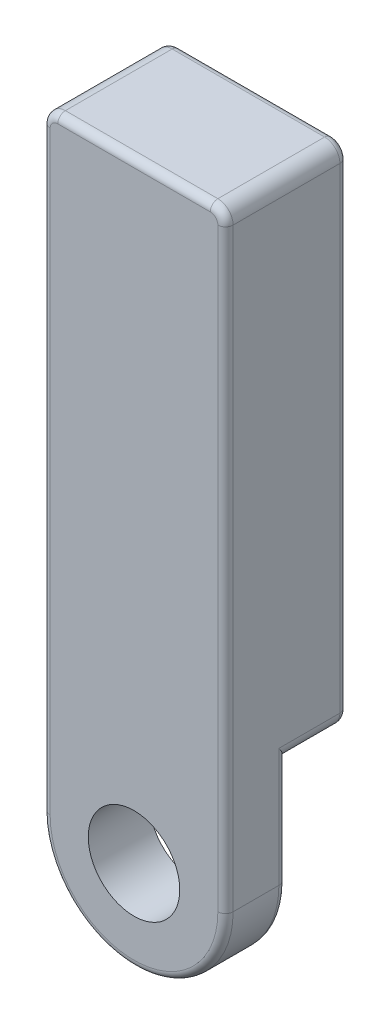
from build123d import *

# Parameters (mm, degrees)
SKETCH1_R          = 9.525
BASE_EXTRUDE_DEPTH = 25.4
SKETCH2_R          = 26.19375
CUT_EXTRUDE1_DEPTH = 12.7
FILLET1_R          = 3.175
FILLET2_R          = 1.5875


with BuildPart() as part:
    # Sketch1 → Base-Extrude (new body)
    with BuildSketch(Plane.XY):
        with BuildLine():
            Line((-19.05, 0), (-19.05, 127))
            Line((-19.05, 127), (19.05, 127))
            Line((19.05, 127), (19.05, 0))
            ThreePointArc((19.05, 0), (0, -19.05), (-19.05, 0))
        make_face()
        Circle(SKETCH1_R, mode=Mode.SUBTRACT)
    extrude(amount=BASE_EXTRUDE_DEPTH)

    # Sketch2 → Cut-Extrude1 (cut)
    with BuildSketch(Plane(origin=(0, 0, 0), x_dir=(-1, 0, 0), z_dir=(0, 0, -1))):
        Circle(SKETCH2_R)
    extrude(amount=-CUT_EXTRUDE1_DEPTH, mode=Mode.SUBTRACT)

    # Fillet1
    fillet1_edges = [part.edges().sort_by_distance(p)[0] for p in [
        (-19.05, 17.978043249, 6.35),
        (19.05, 17.978043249, 6.35),
        (19.05, 127, 12.7),
        (-19.05, 127, 12.7),
    ]]
    fillet(fillet1_edges, radius=FILLET1_R)

    # Fillet2
    fillet2_edges = [part.edges().sort_by_distance(p)[0] for p in [
        (0, -19.05, 12.7),
        (19.05, 12.354228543, 12.7),
        (-19.05, 12.354228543, 12.7),
        (0, 26.19375, 0),
        (-19.05, 74.266728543, 0),
        (0, 127, 0),
        (19.05, 74.266728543, 0),
        (-18.12006403, 126.07006403, 0),
        (18.12006403, 126.07006403, 0),
        (17.396781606, 21.921916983, 0),
        (-17.396781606, 21.921916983, 0),
        (19.05, 61.9125, 25.4),
        (0, -19.05, 25.4),
        (0, 127, 25.4),
        (-18.12006403, 126.07006403, 25.4),
        (18.12006403, 126.07006403, 25.4),
        (-19.05, 61.9125, 25.4),
    ]]
    fillet(fillet2_edges, radius=FILLET2_R)


solid = part.part
